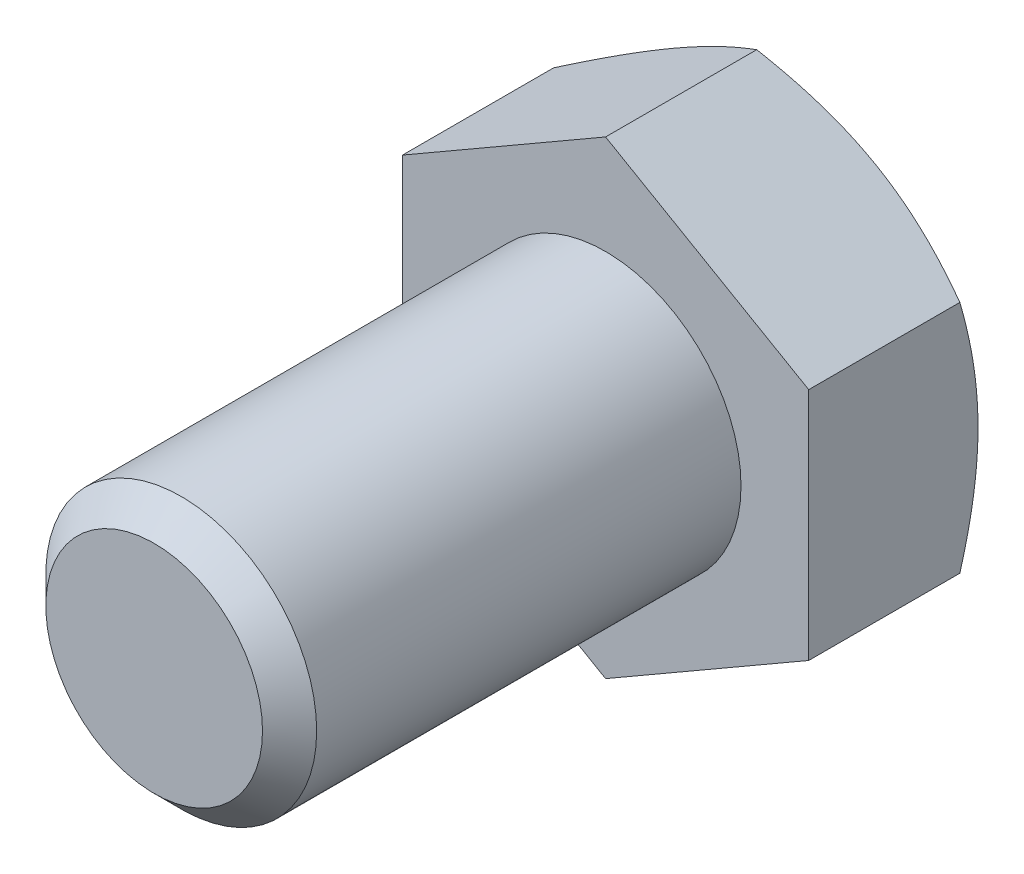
ISO-10303-21;
HEADER;
FILE_DESCRIPTION(('STEP AP214'),'2;1');
FILE_NAME('part.step','',(''),(''),'','','');
FILE_SCHEMA(('AUTOMOTIVE_DESIGN { 1 0 10303 214 1 1 1 1 }'));
ENDSEC;
DATA;
#1=APPLICATION_CONTEXT('core data for automotive mechanical design processes');
#2=APPLICATION_PROTOCOL_DEFINITION('international standard','automotive_design',2000,#1);
#3=PRODUCT_CONTEXT('',#1,'mechanical');
#4=PRODUCT('Part','Part','',(#3));
#5=PRODUCT_RELATED_PRODUCT_CATEGORY('part','',(#4));
#6=PRODUCT_DEFINITION_FORMATION('','',#4);
#7=PRODUCT_DEFINITION_CONTEXT('part definition',#1,'design');
#8=PRODUCT_DEFINITION('design','',#6,#7);
#9=PRODUCT_DEFINITION_SHAPE('','',#8);
#10=(LENGTH_UNIT() NAMED_UNIT(*) SI_UNIT(.MILLI.,.METRE.));
#11=(NAMED_UNIT(*) PLANE_ANGLE_UNIT() SI_UNIT($,.RADIAN.));
#12=(NAMED_UNIT(*) SI_UNIT($,.STERADIAN.) SOLID_ANGLE_UNIT());
#13=UNCERTAINTY_MEASURE_WITH_UNIT(LENGTH_MEASURE(1.E-05),#10,'distance_accuracy_value','');
#14=(GEOMETRIC_REPRESENTATION_CONTEXT(3) GLOBAL_UNCERTAINTY_ASSIGNED_CONTEXT((#13)) GLOBAL_UNIT_ASSIGNED_CONTEXT((#10,
#11,#12)) REPRESENTATION_CONTEXT('',''));
#15=CARTESIAN_POINT('',(0.,0.,0.));
#16=DIRECTION('',(0.,0.,1.));
#17=DIRECTION('',(1.,0.,0.));
#18=AXIS2_PLACEMENT_3D('',#15,#16,#17);
#19=CARTESIAN_POINT('',(0.,0.,20.));
#20=DIRECTION('',(0.,0.,1.));
#21=DIRECTION('',(1.,0.,0.));
#22=AXIS2_PLACEMENT_3D('',#19,#20,#21);
#23=PLANE('',#22);
#24=CARTESIAN_POINT('',(0.,0.,20.));
#25=DIRECTION('',(0.,0.,1.));
#26=DIRECTION('',(1.,0.,0.));
#27=AXIS2_PLACEMENT_3D('',#24,#25,#26);
#28=CIRCLE('',#27,4.8);
#29=CARTESIAN_POINT('',(4.80000000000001,0.,20.));
#30=VERTEX_POINT('',#29);
#31=EDGE_CURVE('E203',#30,#30,#28,.T.);
#32=ORIENTED_EDGE('',*,*,#31,.T.);
#33=EDGE_LOOP('',(#32));
#34=FACE_BOUND('',#33,.T.);
#35=ADVANCED_FACE('F29',(#34),#23,.T.);
#36=CARTESIAN_POINT('',(0.,0.,0.));
#37=DIRECTION('',(0.,0.,1.));
#38=DIRECTION('',(1.,0.,0.));
#39=AXIS2_PLACEMENT_3D('',#36,#37,#38);
#40=CYLINDRICAL_SURFACE('',#39,6.);
#41=CARTESIAN_POINT('',(0.,0.,18.8));
#42=DIRECTION('',(0.,0.,1.));
#43=DIRECTION('',(1.,0.,0.));
#44=AXIS2_PLACEMENT_3D('',#41,#42,#43);
#45=CIRCLE('',#44,6.);
#46=CARTESIAN_POINT('',(6.,0.,18.8));
#47=VERTEX_POINT('',#46);
#48=EDGE_CURVE('E205',#47,#47,#45,.F.);
#49=ORIENTED_EDGE('',*,*,#48,.T.);
#50=EDGE_LOOP('',(#49));
#51=FACE_BOUND('',#50,.T.);
#52=CARTESIAN_POINT('',(0.,0.,0.));
#53=DIRECTION('',(0.,0.,1.));
#54=DIRECTION('',(1.,0.,0.));
#55=AXIS2_PLACEMENT_3D('',#52,#53,#54);
#56=CIRCLE('',#55,6.);
#57=CARTESIAN_POINT('',(6.,0.,0.));
#58=VERTEX_POINT('',#57);
#59=EDGE_CURVE('E206',#58,#58,#56,.F.);
#60=ORIENTED_EDGE('',*,*,#59,.F.);
#61=EDGE_LOOP('',(#60));
#62=FACE_BOUND('',#61,.T.);
#63=ADVANCED_FACE('F194',(#51,#62),#40,.T.);
#64=CARTESIAN_POINT('',(0.,0.,20.));
#65=DIRECTION('',(0.,0.,-1.));
#66=DIRECTION('',(-1.,0.,0.));
#67=AXIS2_PLACEMENT_3D('',#64,#65,#66);
#68=CONICAL_SURFACE('',#67,4.8,0.785398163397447);
#69=ORIENTED_EDGE('',*,*,#48,.F.);
#70=EDGE_LOOP('',(#69));
#71=FACE_BOUND('',#70,.T.);
#72=ORIENTED_EDGE('',*,*,#31,.F.);
#73=EDGE_LOOP('',(#72));
#74=FACE_BOUND('',#73,.T.);
#75=ADVANCED_FACE('F199',(#71,#74),#68,.T.);
#76=CARTESIAN_POINT('',(0.,10.3923048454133,-7.5));
#77=DIRECTION('',(0.499999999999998,0.86602540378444,0.));
#78=DIRECTION('',(-0.86602540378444,0.499999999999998,0.));
#79=AXIS2_PLACEMENT_3D('',#76,#77,#78);
#80=PLANE('',#79);
#81=CARTESIAN_POINT('',(-0.000200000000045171,10.3924203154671,-6.69608575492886));
#82=CARTESIAN_POINT('',(0.197607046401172,10.2782163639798,-6.76201799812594));
#83=CARTESIAN_POINT('',(0.396185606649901,10.1635669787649,-6.82495859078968));
#84=CARTESIAN_POINT('',(0.794955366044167,9.93333715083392,-6.94403100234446));
#85=CARTESIAN_POINT('',(0.995147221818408,9.81775632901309,-7.00015988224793));
#86=CARTESIAN_POINT('',(1.39751505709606,9.5854491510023,-7.10484803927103));
#87=CARTESIAN_POINT('',(1.59969459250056,9.46872074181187,-7.15338922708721));
#88=CARTESIAN_POINT('',(2.00542875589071,9.23447001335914,-7.24185148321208));
#89=CARTESIAN_POINT('',(2.20898309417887,9.11694786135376,-7.28177431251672));
#90=CARTESIAN_POINT('',(2.61230590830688,8.88408932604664,-7.35131532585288));
#91=CARTESIAN_POINT('',(2.81204459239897,8.76877014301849,-7.3811624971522));
#92=CARTESIAN_POINT('',(3.21241567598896,8.53761579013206,-7.43120669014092));
#93=CARTESIAN_POINT('',(3.41304799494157,8.42178066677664,-7.45140456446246));
#94=CARTESIAN_POINT('',(3.81466063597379,8.18990950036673,-7.48164565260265));
#95=CARTESIAN_POINT('',(4.0156403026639,8.07387383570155,-7.4917003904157));
#96=CARTESIAN_POINT('',(4.41778459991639,7.84169571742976,-7.50143766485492));
#97=CARTESIAN_POINT('',(4.61894922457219,7.7255532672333,-7.50112052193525));
#98=CARTESIAN_POINT('',(4.99503261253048,7.50842142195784,-7.49083604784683));
#99=CARTESIAN_POINT('',(5.16997789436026,7.40741671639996,-7.48212325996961));
#100=CARTESIAN_POINT('',(5.51945867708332,7.2056438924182,-7.45702265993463));
#101=CARTESIAN_POINT('',(5.69399414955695,7.10487579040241,-7.44063433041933));
#102=CARTESIAN_POINT('',(6.21692487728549,6.80296159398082,-7.38034344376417));
#103=CARTESIAN_POINT('',(6.5643945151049,6.60234990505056,-7.32532251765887));
#104=CARTESIAN_POINT('',(7.26301962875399,6.19899850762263,-7.18776952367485));
#105=CARTESIAN_POINT('',(7.61408594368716,5.99631027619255,-7.10465438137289));
#106=CARTESIAN_POINT('',(8.3109833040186,5.59395639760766,-6.91601746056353));
#107=CARTESIAN_POINT('',(8.65682327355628,5.39428559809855,-6.81053998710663));
#108=CARTESIAN_POINT('',(9.0002,5.19603695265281,-6.69608575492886));
#109=B_SPLINE_CURVE_WITH_KNOTS('',3,(#81,#82,#83,#84,#85,#86,#87,#88,#89,#90,#91,#92,#93,#94,
#95,#96,#97,#98,#99,#100,#101,#102,#103,#104,#105,#106,#107,#108),.UNSPECIFIED.,.F.,.F.,(4,2,2,
2,2,2,2,2,2,2,2,2,2,4),(0.,0.713219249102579,1.42674513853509,2.14194697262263,2.85700253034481,
3.55449749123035,4.25193080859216,4.94857085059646,5.64518936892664,6.25162976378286,
6.85811104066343,8.07193747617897,9.31268391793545,10.5509947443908),.UNSPECIFIED.);
#110=CARTESIAN_POINT('',(0.,10.3923048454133,-6.69615242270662));
#111=VERTEX_POINT('',#110);
#112=CARTESIAN_POINT('',(4.49999999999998,7.79422863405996,-7.5));
#113=VERTEX_POINT('',#112);
#114=EDGE_CURVE('E239',#111,#113,#109,.T.);
#115=ORIENTED_EDGE('',*,*,#114,.F.);
#116=DIRECTION('',(0.,0.,1.));
#117=VECTOR('',#116,1.);
#118=CARTESIAN_POINT('',(0.,10.3923048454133,-7.5));
#119=LINE('',#118,#117);
#120=CARTESIAN_POINT('',(0.,10.3923048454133,0.));
#121=VERTEX_POINT('',#120);
#122=EDGE_CURVE('E213',#111,#121,#119,.T.);
#123=ORIENTED_EDGE('',*,*,#122,.T.);
#124=DIRECTION('',(-0.86602540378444,0.499999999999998,0.));
#125=VECTOR('',#124,1.);
#126=CARTESIAN_POINT('',(0.,10.3923048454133,0.));
#127=LINE('',#126,#125);
#128=CARTESIAN_POINT('',(9.,5.19615242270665,0.));
#129=VERTEX_POINT('',#128);
#130=EDGE_CURVE('E237',#129,#121,#127,.T.);
#131=ORIENTED_EDGE('',*,*,#130,.F.);
#132=DIRECTION('',(0.,0.,1.));
#133=VECTOR('',#132,1.);
#134=CARTESIAN_POINT('',(9.,5.19615242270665,-7.5));
#135=LINE('',#134,#133);
#136=CARTESIAN_POINT('',(9.,5.19615242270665,-6.69615242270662));
#137=VERTEX_POINT('',#136);
#138=EDGE_CURVE('E210',#137,#129,#135,.T.);
#139=ORIENTED_EDGE('',*,*,#138,.F.);
#140=EDGE_CURVE('E169',#113,#137,#109,.T.);
#141=ORIENTED_EDGE('',*,*,#140,.F.);
#142=EDGE_LOOP('',(#115,#123,#131,#139,#141));
#143=FACE_BOUND('',#142,.T.);
#144=ADVANCED_FACE('F179',(#143),#80,.T.);
#145=CARTESIAN_POINT('',(9.,-5.19615242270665,-7.5));
#146=DIRECTION('',(1.,0.,0.));
#147=DIRECTION('',(0.,0.,-1.));
#148=AXIS2_PLACEMENT_3D('',#145,#146,#147);
#149=PLANE('',#148);
#150=CARTESIAN_POINT('',(9.,-14.1938054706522,-2.9928177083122));
#151=CARTESIAN_POINT('',(9.,-13.7986249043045,-3.18545400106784));
#152=CARTESIAN_POINT('',(9.,-13.4025620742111,-3.37631016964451));
#153=CARTESIAN_POINT('',(9.,-12.6082034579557,-3.75346543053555));
#154=CARTESIAN_POINT('',(9.,-12.2099073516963,-3.93976384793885));
#155=CARTESIAN_POINT('',(9.,-11.4086732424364,-4.30769386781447));
#156=CARTESIAN_POINT('',(9.,-11.005721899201,-4.48929651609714));
#157=CARTESIAN_POINT('',(9.,-10.1966954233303,-4.84537774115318));
#158=CARTESIAN_POINT('',(9.,-9.79062043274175,-5.01985663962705));
#159=CARTESIAN_POINT('',(9.,-8.96081603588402,-5.36560228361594));
#160=CARTESIAN_POINT('',(9.,-8.53695616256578,-5.53655757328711));
#161=CARTESIAN_POINT('',(9.,-7.68436682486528,-5.86609252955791));
#162=CARTESIAN_POINT('',(9.,-7.25563683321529,-6.02467084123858));
#163=CARTESIAN_POINT('',(9.,-6.39334839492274,-6.3254614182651));
#164=CARTESIAN_POINT('',(9.,-5.95980093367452,-6.46770484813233));
#165=CARTESIAN_POINT('',(9.,-5.08650675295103,-6.73142002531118));
#166=CARTESIAN_POINT('',(9.,-4.64676195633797,-6.85289806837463));
#167=CARTESIAN_POINT('',(9.,-3.7631885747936,-7.06875933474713));
#168=CARTESIAN_POINT('',(9.,-3.31939822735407,-7.16329494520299));
#169=CARTESIAN_POINT('',(9.,-2.64948950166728,-7.28091249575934));
#170=CARTESIAN_POINT('',(9.,-2.42546830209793,-7.31608884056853));
#171=CARTESIAN_POINT('',(9.,-1.97623392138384,-7.37769613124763));
#172=CARTESIAN_POINT('',(9.,-1.75102085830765,-7.40412792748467));
#173=CARTESIAN_POINT('',(9.,-1.30274989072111,-7.44737513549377));
#174=CARTESIAN_POINT('',(9.,-1.07970414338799,-7.46431601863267));
#175=CARTESIAN_POINT('',(9.,-0.633095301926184,-7.4887410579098));
#176=CARTESIAN_POINT('',(9.,-0.409532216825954,-7.49622537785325));
#177=CARTESIAN_POINT('',(9.,0.0377121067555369,-7.50155767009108));
#178=CARTESIAN_POINT('',(9.,0.261393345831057,-7.49940559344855));
#179=CARTESIAN_POINT('',(9.,0.70846074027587,-7.48552018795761));
#180=CARTESIAN_POINT('',(9.,0.931846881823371,-7.47378642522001));
#181=CARTESIAN_POINT('',(9.,1.46162752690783,-7.43485039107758));
#182=CARTESIAN_POINT('',(9.,1.76772399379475,-7.40349650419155));
#183=CARTESIAN_POINT('',(9.,2.37778404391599,-7.32445593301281));
#184=CARTESIAN_POINT('',(9.,2.6817473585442,-7.27676722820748));
#185=CARTESIAN_POINT('',(9.,3.59000335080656,-7.1117163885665));
#186=CARTESIAN_POINT('',(9.,4.19036603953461,-6.9723942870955));
#187=CARTESIAN_POINT('',(9.,5.0885815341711,-6.72898039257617));
#188=CARTESIAN_POINT('',(9.,5.39104017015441,-6.64089135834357));
#189=CARTESIAN_POINT('',(9.,5.99302412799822,-6.4551143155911));
#190=CARTESIAN_POINT('',(9.,6.29254942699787,-6.35742623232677));
#191=CARTESIAN_POINT('',(9.,6.88875586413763,-6.15405553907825));
#192=CARTESIAN_POINT('',(9.,7.18543776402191,-6.0483751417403));
#193=CARTESIAN_POINT('',(9.,7.77631041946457,-5.83030807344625));
#194=CARTESIAN_POINT('',(9.,8.07050123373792,-5.71792156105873));
#195=CARTESIAN_POINT('',(9.,8.86768097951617,-5.40462740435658));
#196=CARTESIAN_POINT('',(9.,9.36851420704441,-5.19823951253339));
#197=CARTESIAN_POINT('',(9.,10.3649647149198,-4.77318997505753));
#198=CARTESIAN_POINT('',(9.,10.860581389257,-4.5545269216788));
#199=CARTESIAN_POINT('',(9.,11.8478077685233,-4.10785524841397));
#200=CARTESIAN_POINT('',(9.,12.3394158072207,-3.87984295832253));
#201=CARTESIAN_POINT('',(9.,13.3192435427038,-3.41672758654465));
#202=CARTESIAN_POINT('',(9.,13.8074633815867,-3.18162480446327));
#203=CARTESIAN_POINT('',(9.,14.7819931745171,-2.70549247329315));
#204=CARTESIAN_POINT('',(9.,15.2682986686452,-2.46445381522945));
#205=CARTESIAN_POINT('',(9.,16.2387067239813,-1.97797920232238));
#206=CARTESIAN_POINT('',(9.,16.722809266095,-1.73254320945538));
#207=CARTESIAN_POINT('',(9.,17.6890969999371,-1.23819989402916));
#208=CARTESIAN_POINT('',(9.,18.1712826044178,-0.989293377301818));
#209=CARTESIAN_POINT('',(9.,19.1341609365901,-0.488607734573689));
#210=CARTESIAN_POINT('',(9.,19.6148536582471,-0.23682859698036));
#211=CARTESIAN_POINT('',(9.,20.9522159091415,0.467839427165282));
#212=CARTESIAN_POINT('',(9.,21.8075292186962,0.923301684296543));
#213=CARTESIAN_POINT('',(9.,23.5152984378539,1.83966951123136));
#214=CARTESIAN_POINT('',(9.,24.3677541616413,2.3005754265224));
#215=CARTESIAN_POINT('',(9.,26.0675482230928,3.22485857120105));
#216=CARTESIAN_POINT('',(9.,26.9148940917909,3.68822195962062));
#217=CARTESIAN_POINT('',(9.,28.1846057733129,4.38556367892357));
#218=CARTESIAN_POINT('',(9.,28.6076082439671,4.61838432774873));
#219=CARTESIAN_POINT('',(9.,29.4532343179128,5.08471147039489));
#220=CARTESIAN_POINT('',(9.,29.8758579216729,5.31821796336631));
#221=CARTESIAN_POINT('',(9.,30.2983153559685,5.55202477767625));
#222=B_SPLINE_CURVE_WITH_KNOTS('',3,(#150,#151,#152,#153,#154,#155,#156,#157,#158,#159,#160,
#161,#162,#163,#164,#165,#166,#167,#168,#169,#170,#171,#172,#173,#174,#175,#176,#177,#178,#179,
#180,#181,#182,#183,#184,#185,#186,#187,#188,#189,#190,#191,#192,#193,#194,#195,#196,#197,#198,
#199,#200,#201,#202,#203,#204,#205,#206,#207,#208,#209,#210,#211,#212,#213,#214,#215,#216,#217,
#218,#219,#220,#221),.UNSPECIFIED.,.F.,.F.,(4,2,2,2,2,2,2,2,2,2,2,2,2,2,2,2,2,2,2,2,2,2,2,2,2,2,
2,2,2,2,2,2,2,2,2,4),(0.,1.31891143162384,2.63801699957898,3.9639117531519,5.28974656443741,
6.66070766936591,8.03181864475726,9.40026868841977,10.7683030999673,12.1284389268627,
12.8085936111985,13.488682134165,14.1595537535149,14.8304137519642,15.5012771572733,
16.172170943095,17.094749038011,18.0174412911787,19.8637129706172,20.808703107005,
21.7537006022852,22.6984374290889,23.6431519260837,25.267980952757,26.8929966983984,
28.5186565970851,30.1442479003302,31.7725119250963,33.400790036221,35.0286961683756,
36.6566088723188,39.5636489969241,42.4708746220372,45.3681585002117,46.8166845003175,
48.2652087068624),.UNSPECIFIED.);
#223=CARTESIAN_POINT('',(9.,0.,-7.5));
#224=VERTEX_POINT('',#223);
#225=EDGE_CURVE('E167',#137,#224,#222,.F.);
#226=ORIENTED_EDGE('',*,*,#225,.F.);
#227=ORIENTED_EDGE('',*,*,#138,.T.);
#228=DIRECTION('',(0.,1.,0.));
#229=VECTOR('',#228,1.);
#230=CARTESIAN_POINT('',(9.,-5.19615242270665,0.));
#231=LINE('',#230,#229);
#232=CARTESIAN_POINT('',(9.,-5.19615242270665,0.));
#233=VERTEX_POINT('',#232);
#234=EDGE_CURVE('E215',#233,#129,#231,.T.);
#235=ORIENTED_EDGE('',*,*,#234,.F.);
#236=DIRECTION('',(0.,0.,1.));
#237=VECTOR('',#236,1.);
#238=CARTESIAN_POINT('',(9.,-5.19615242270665,-7.5));
#239=LINE('',#238,#237);
#240=CARTESIAN_POINT('',(9.,-5.19615242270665,-6.69615242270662));
#241=VERTEX_POINT('',#240);
#242=EDGE_CURVE('E221',#241,#233,#239,.T.);
#243=ORIENTED_EDGE('',*,*,#242,.F.);
#244=EDGE_CURVE('E162',#224,#241,#222,.F.);
#245=ORIENTED_EDGE('',*,*,#244,.F.);
#246=EDGE_LOOP('',(#226,#227,#235,#243,#245));
#247=FACE_BOUND('',#246,.T.);
#248=ADVANCED_FACE('F175',(#247),#149,.T.);
#249=CARTESIAN_POINT('',(0.,-10.3923048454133,-7.5));
#250=DIRECTION('',(0.499999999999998,-0.86602540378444,0.));
#251=DIRECTION('',(0.86602540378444,0.499999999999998,0.));
#252=AXIS2_PLACEMENT_3D('',#249,#250,#251);
#253=PLANE('',#252);
#254=CARTESIAN_POINT('',(9.0002,-5.19603695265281,-6.69608575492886));
#255=CARTESIAN_POINT('',(8.80239295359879,-5.31024090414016,-6.76201799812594));
#256=CARTESIAN_POINT('',(8.60381439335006,-5.42489028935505,-6.82495859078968));
#257=CARTESIAN_POINT('',(8.20504463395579,-5.65512011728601,-6.94403100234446));
#258=CARTESIAN_POINT('',(8.00485277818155,-5.77070093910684,-7.00015988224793));
#259=CARTESIAN_POINT('',(7.6024849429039,-6.00300811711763,-7.10484803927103));
#260=CARTESIAN_POINT('',(7.4003054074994,-6.11973652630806,-7.15338922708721));
#261=CARTESIAN_POINT('',(6.99457124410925,-6.35398725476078,-7.24185148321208));
#262=CARTESIAN_POINT('',(6.79101690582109,-6.47150940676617,-7.28177431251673));
#263=CARTESIAN_POINT('',(6.38769409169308,-6.70436794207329,-7.35131532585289));
#264=CARTESIAN_POINT('',(6.18795540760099,-6.81968712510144,-7.3811624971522));
#265=CARTESIAN_POINT('',(5.787584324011,-7.05084147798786,-7.43120669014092));
#266=CARTESIAN_POINT('',(5.58695200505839,-7.16667660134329,-7.45140456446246));
#267=CARTESIAN_POINT('',(5.18533936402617,-7.3985477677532,-7.48164565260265));
#268=CARTESIAN_POINT('',(4.98435969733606,-7.51458343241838,-7.4917003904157));
#269=CARTESIAN_POINT('',(4.58221540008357,-7.74676155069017,-7.50143766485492));
#270=CARTESIAN_POINT('',(4.38105077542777,-7.86290400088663,-7.50112052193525));
#271=CARTESIAN_POINT('',(4.00496738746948,-8.08003584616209,-7.49083604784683));
#272=CARTESIAN_POINT('',(3.83002210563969,-8.18104055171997,-7.48212325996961));
#273=CARTESIAN_POINT('',(3.48054132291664,-8.38281337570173,-7.45702265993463));
#274=CARTESIAN_POINT('',(3.30600585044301,-8.48358147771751,-7.44063433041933));
#275=CARTESIAN_POINT('',(2.78307512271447,-8.78549567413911,-7.38034344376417));
#276=CARTESIAN_POINT('',(2.43560548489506,-8.98610736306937,-7.32532251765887));
#277=CARTESIAN_POINT('',(1.73698037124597,-9.3894587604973,-7.18776952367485));
#278=CARTESIAN_POINT('',(1.38591405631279,-9.59214699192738,-7.10465438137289));
#279=CARTESIAN_POINT('',(0.689016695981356,-9.99450087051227,-6.91601746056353));
#280=CARTESIAN_POINT('',(0.34317672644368,-10.1941716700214,-6.81053998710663));
#281=CARTESIAN_POINT('',(-0.000200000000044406,-10.3924203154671,-6.69608575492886));
#282=B_SPLINE_CURVE_WITH_KNOTS('',3,(#254,#255,#256,#257,#258,#259,#260,#261,#262,#263,#264,
#265,#266,#267,#268,#269,#270,#271,#272,#273,#274,#275,#276,#277,#278,#279,#280,#281),
.UNSPECIFIED.,.F.,.F.,(4,2,2,2,2,2,2,2,2,2,2,2,2,4),(0.,0.713219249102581,1.42674513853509,
2.14194697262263,2.85700253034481,3.55449749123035,4.25193080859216,4.94857085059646,
5.64518936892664,6.25162976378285,6.85811104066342,8.07193747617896,9.31268391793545,
10.5509947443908),.UNSPECIFIED.);
#283=CARTESIAN_POINT('',(4.49999999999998,-7.79422863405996,-7.5));
#284=VERTEX_POINT('',#283);
#285=EDGE_CURVE('E168',#241,#284,#282,.T.);
#286=ORIENTED_EDGE('',*,*,#285,.F.);
#287=ORIENTED_EDGE('',*,*,#242,.T.);
#288=DIRECTION('',(0.86602540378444,0.499999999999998,0.));
#289=VECTOR('',#288,1.);
#290=CARTESIAN_POINT('',(0.,-10.3923048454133,0.));
#291=LINE('',#290,#289);
#292=CARTESIAN_POINT('',(0.,-10.3923048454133,0.));
#293=VERTEX_POINT('',#292);
#294=EDGE_CURVE('E226',#293,#233,#291,.T.);
#295=ORIENTED_EDGE('',*,*,#294,.F.);
#296=DIRECTION('',(0.,0.,1.));
#297=VECTOR('',#296,1.);
#298=CARTESIAN_POINT('',(0.,-10.3923048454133,-7.5));
#299=LINE('',#298,#297);
#300=CARTESIAN_POINT('',(0.,-10.3923048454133,-6.69615242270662));
#301=VERTEX_POINT('',#300);
#302=EDGE_CURVE('E219',#301,#293,#299,.T.);
#303=ORIENTED_EDGE('',*,*,#302,.F.);
#304=EDGE_CURVE('E156',#284,#301,#282,.T.);
#305=ORIENTED_EDGE('',*,*,#304,.F.);
#306=EDGE_LOOP('',(#286,#287,#295,#303,#305));
#307=FACE_BOUND('',#306,.T.);
#308=ADVANCED_FACE('F178',(#307),#253,.T.);
#309=CARTESIAN_POINT('',(0.,-10.3923048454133,-7.5));
#310=DIRECTION('',(-0.500000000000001,-0.866025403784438,0.));
#311=DIRECTION('',(0.866025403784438,-0.500000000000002,0.));
#312=AXIS2_PLACEMENT_3D('',#309,#310,#311);
#313=PLANE('',#312);
#314=CARTESIAN_POINT('',(0.000199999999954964,-10.3924203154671,-6.69608575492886));
#315=CARTESIAN_POINT('',(-0.197607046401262,-10.2782163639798,-6.76201799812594));
#316=CARTESIAN_POINT('',(-0.39618560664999,-10.1635669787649,-6.82495859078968));
#317=CARTESIAN_POINT('',(-0.794955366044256,-9.93333715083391,-6.94403100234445));
#318=CARTESIAN_POINT('',(-0.995147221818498,-9.81775632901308,-7.00015988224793));
#319=CARTESIAN_POINT('',(-1.39751505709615,-9.58544915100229,-7.10484803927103));
#320=CARTESIAN_POINT('',(-1.59969459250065,-9.46872074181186,-7.15338922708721));
#321=CARTESIAN_POINT('',(-2.0054287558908,-9.23447001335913,-7.24185148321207));
#322=CARTESIAN_POINT('',(-2.20898309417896,-9.11694786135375,-7.28177431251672));
#323=CARTESIAN_POINT('',(-2.61230590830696,-8.88408932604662,-7.35131532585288));
#324=CARTESIAN_POINT('',(-2.81204459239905,-8.76877014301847,-7.38116249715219));
#325=CARTESIAN_POINT('',(-3.21241567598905,-8.53761579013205,-7.43120669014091));
#326=CARTESIAN_POINT('',(-3.41304799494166,-8.42178066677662,-7.45140456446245));
#327=CARTESIAN_POINT('',(-3.81466063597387,-8.18990950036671,-7.48164565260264));
#328=CARTESIAN_POINT('',(-4.01564030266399,-8.07387383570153,-7.49170039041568));
#329=CARTESIAN_POINT('',(-4.41778459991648,-7.84169571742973,-7.5014376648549));
#330=CARTESIAN_POINT('',(-4.61894922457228,-7.72555326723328,-7.50112052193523));
#331=CARTESIAN_POINT('',(-4.99503261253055,-7.50842142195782,-7.49083604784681));
#332=CARTESIAN_POINT('',(-5.16997789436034,-7.40741671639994,-7.48212325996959));
#333=CARTESIAN_POINT('',(-5.51945867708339,-7.20564389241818,-7.45702265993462));
#334=CARTESIAN_POINT('',(-5.69399414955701,-7.1048757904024,-7.44063433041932));
#335=CARTESIAN_POINT('',(-6.21692487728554,-6.8029615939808,-7.38034344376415));
#336=CARTESIAN_POINT('',(-6.56439451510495,-6.60234990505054,-7.32532251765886));
#337=CARTESIAN_POINT('',(-7.26301962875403,-6.19899850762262,-7.18776952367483));
#338=CARTESIAN_POINT('',(-7.61408594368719,-5.99631027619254,-7.10465438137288));
#339=CARTESIAN_POINT('',(-8.31098330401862,-5.59395639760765,-6.91601746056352));
#340=CARTESIAN_POINT('',(-8.65682327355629,-5.39428559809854,-6.81053998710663));
#341=CARTESIAN_POINT('',(-9.0002,-5.19603695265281,-6.69608575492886));
#342=B_SPLINE_CURVE_WITH_KNOTS('',3,(#314,#315,#316,#317,#318,#319,#320,#321,#322,#323,#324,
#325,#326,#327,#328,#329,#330,#331,#332,#333,#334,#335,#336,#337,#338,#339,#340,#341),
.UNSPECIFIED.,.F.,.F.,(4,2,2,2,2,2,2,2,2,2,2,2,2,4),(0.,0.713219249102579,1.42674513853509,
2.14194697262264,2.85700253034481,3.55449749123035,4.25193080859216,4.94857085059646,
5.64518936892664,6.25162976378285,6.85811104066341,8.07193747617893,9.31268391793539,
10.5509947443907),.UNSPECIFIED.);
#343=CARTESIAN_POINT('',(-4.50000000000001,-7.79422863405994,-7.5));
#344=VERTEX_POINT('',#343);
#345=EDGE_CURVE('E258',#301,#344,#342,.T.);
#346=ORIENTED_EDGE('',*,*,#345,.F.);
#347=ORIENTED_EDGE('',*,*,#302,.T.);
#348=DIRECTION('',(0.866025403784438,-0.500000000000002,0.));
#349=VECTOR('',#348,1.);
#350=CARTESIAN_POINT('',(0.,-10.3923048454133,0.));
#351=LINE('',#350,#349);
#352=CARTESIAN_POINT('',(-9.,-5.19615242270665,0.));
#353=VERTEX_POINT('',#352);
#354=EDGE_CURVE('E229',#353,#293,#351,.T.);
#355=ORIENTED_EDGE('',*,*,#354,.F.);
#356=DIRECTION('',(0.,0.,1.));
#357=VECTOR('',#356,1.);
#358=CARTESIAN_POINT('',(-9.,-5.19615242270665,-7.5));
#359=LINE('',#358,#357);
#360=CARTESIAN_POINT('',(-9.,-5.19615242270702,-6.69615242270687));
#361=VERTEX_POINT('',#360);
#362=EDGE_CURVE('E217',#361,#353,#359,.T.);
#363=ORIENTED_EDGE('',*,*,#362,.F.);
#364=EDGE_CURVE('E105',#344,#361,#342,.T.);
#365=ORIENTED_EDGE('',*,*,#364,.F.);
#366=EDGE_LOOP('',(#346,#347,#355,#363,#365));
#367=FACE_BOUND('',#366,.T.);
#368=ADVANCED_FACE('F183',(#367),#313,.T.);
#369=CARTESIAN_POINT('',(-9.,-5.19615242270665,-7.5));
#370=DIRECTION('',(-1.,0.,0.));
#371=DIRECTION('',(0.,0.,1.));
#372=AXIS2_PLACEMENT_3D('',#369,#370,#371);
#373=PLANE('',#372);
#374=CARTESIAN_POINT('',(-9.,-14.1938054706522,-2.99281770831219));
#375=CARTESIAN_POINT('',(-9.,-13.7986249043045,-3.18545400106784));
#376=CARTESIAN_POINT('',(-9.,-13.4025620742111,-3.37631016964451));
#377=CARTESIAN_POINT('',(-9.,-12.6082034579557,-3.75346543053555));
#378=CARTESIAN_POINT('',(-9.,-12.2099073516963,-3.93976384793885));
#379=CARTESIAN_POINT('',(-9.,-11.4086732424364,-4.30769386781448));
#380=CARTESIAN_POINT('',(-9.,-11.005721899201,-4.48929651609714));
#381=CARTESIAN_POINT('',(-9.,-10.1966954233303,-4.84537774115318));
#382=CARTESIAN_POINT('',(-9.,-9.79062043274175,-5.01985663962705));
#383=CARTESIAN_POINT('',(-9.,-8.96081603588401,-5.36560228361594));
#384=CARTESIAN_POINT('',(-9.,-8.53695616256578,-5.53655757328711));
#385=CARTESIAN_POINT('',(-9.,-7.68436682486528,-5.86609252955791));
#386=CARTESIAN_POINT('',(-9.,-7.25563683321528,-6.02467084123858));
#387=CARTESIAN_POINT('',(-9.,-6.39334839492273,-6.3254614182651));
#388=CARTESIAN_POINT('',(-9.,-5.95980093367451,-6.46770484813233));
#389=CARTESIAN_POINT('',(-9.,-5.08650675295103,-6.73142002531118));
#390=CARTESIAN_POINT('',(-9.,-4.64676195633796,-6.85289806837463));
#391=CARTESIAN_POINT('',(-9.,-3.76318857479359,-7.06875933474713));
#392=CARTESIAN_POINT('',(-9.,-3.31939822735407,-7.16329494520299));
#393=CARTESIAN_POINT('',(-9.,-2.64948950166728,-7.28091249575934));
#394=CARTESIAN_POINT('',(-9.,-2.42546830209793,-7.31608884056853));
#395=CARTESIAN_POINT('',(-9.,-1.97623392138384,-7.37769613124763));
#396=CARTESIAN_POINT('',(-9.,-1.75102085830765,-7.40412792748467));
#397=CARTESIAN_POINT('',(-9.,-1.3027498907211,-7.44737513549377));
#398=CARTESIAN_POINT('',(-9.,-1.07970414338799,-7.46431601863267));
#399=CARTESIAN_POINT('',(-9.,-0.633095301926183,-7.4887410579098));
#400=CARTESIAN_POINT('',(-9.,-0.409532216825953,-7.49622537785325));
#401=CARTESIAN_POINT('',(-9.,0.0377121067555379,-7.50155767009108));
#402=CARTESIAN_POINT('',(-9.,0.261393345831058,-7.49940559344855));
#403=CARTESIAN_POINT('',(-9.,0.708460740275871,-7.48552018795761));
#404=CARTESIAN_POINT('',(-9.,0.931846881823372,-7.47378642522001));
#405=CARTESIAN_POINT('',(-9.,1.46162752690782,-7.43485039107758));
#406=CARTESIAN_POINT('',(-9.,1.76772399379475,-7.40349650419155));
#407=CARTESIAN_POINT('',(-9.,2.37778404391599,-7.32445593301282));
#408=CARTESIAN_POINT('',(-9.,2.6817473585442,-7.27676722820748));
#409=CARTESIAN_POINT('',(-9.,3.59000335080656,-7.1117163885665));
#410=CARTESIAN_POINT('',(-9.,4.19036603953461,-6.9723942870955));
#411=CARTESIAN_POINT('',(-9.,5.0885815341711,-6.72898039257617));
#412=CARTESIAN_POINT('',(-9.,5.39104017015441,-6.64089135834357));
#413=CARTESIAN_POINT('',(-9.,5.99302412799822,-6.4551143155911));
#414=CARTESIAN_POINT('',(-9.,6.29254942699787,-6.35742623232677));
#415=CARTESIAN_POINT('',(-9.,6.88875586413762,-6.15405553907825));
#416=CARTESIAN_POINT('',(-9.,7.18543776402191,-6.0483751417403));
#417=CARTESIAN_POINT('',(-9.,7.77631041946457,-5.83030807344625));
#418=CARTESIAN_POINT('',(-9.,8.07050123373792,-5.71792156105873));
#419=CARTESIAN_POINT('',(-9.,8.86768097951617,-5.40462740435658));
#420=CARTESIAN_POINT('',(-9.,9.36851420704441,-5.19823951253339));
#421=CARTESIAN_POINT('',(-9.,10.3649647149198,-4.77318997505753));
#422=CARTESIAN_POINT('',(-9.,10.860581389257,-4.5545269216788));
#423=CARTESIAN_POINT('',(-9.,11.8478077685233,-4.10785524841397));
#424=CARTESIAN_POINT('',(-9.,12.3394158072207,-3.87984295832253));
#425=CARTESIAN_POINT('',(-9.,13.3192435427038,-3.41672758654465));
#426=CARTESIAN_POINT('',(-9.,13.8074633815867,-3.18162480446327));
#427=CARTESIAN_POINT('',(-9.,14.7819931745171,-2.70549247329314));
#428=CARTESIAN_POINT('',(-9.,15.2682986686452,-2.46445381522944));
#429=CARTESIAN_POINT('',(-9.,16.2387067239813,-1.97797920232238));
#430=CARTESIAN_POINT('',(-9.,16.7228092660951,-1.73254320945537));
#431=CARTESIAN_POINT('',(-9.,17.6890969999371,-1.23819989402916));
#432=CARTESIAN_POINT('',(-9.,18.1712826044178,-0.98929337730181));
#433=CARTESIAN_POINT('',(-9.,19.1341609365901,-0.488607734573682));
#434=CARTESIAN_POINT('',(-9.,19.6148536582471,-0.236828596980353));
#435=CARTESIAN_POINT('',(-9.,20.9522159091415,0.467839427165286));
#436=CARTESIAN_POINT('',(-9.,21.8075292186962,0.923301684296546));
#437=CARTESIAN_POINT('',(-9.,23.5152984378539,1.83966951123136));
#438=CARTESIAN_POINT('',(-9.,24.3677541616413,2.3005754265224));
#439=CARTESIAN_POINT('',(-9.,26.0675482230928,3.22485857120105));
#440=CARTESIAN_POINT('',(-9.,26.9148940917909,3.68822195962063));
#441=CARTESIAN_POINT('',(-9.,28.184605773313,4.38556367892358));
#442=CARTESIAN_POINT('',(-9.,28.6076082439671,4.61838432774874));
#443=CARTESIAN_POINT('',(-9.,29.4532343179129,5.08471147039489));
#444=CARTESIAN_POINT('',(-9.,29.8758579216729,5.31821796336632));
#445=CARTESIAN_POINT('',(-9.,30.2983153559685,5.55202477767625));
#446=B_SPLINE_CURVE_WITH_KNOTS('',3,(#374,#375,#376,#377,#378,#379,#380,#381,#382,#383,#384,
#385,#386,#387,#388,#389,#390,#391,#392,#393,#394,#395,#396,#397,#398,#399,#400,#401,#402,#403,
#404,#405,#406,#407,#408,#409,#410,#411,#412,#413,#414,#415,#416,#417,#418,#419,#420,#421,#422,
#423,#424,#425,#426,#427,#428,#429,#430,#431,#432,#433,#434,#435,#436,#437,#438,#439,#440,#441,
#442,#443,#444,#445),.UNSPECIFIED.,.F.,.F.,(4,2,2,2,2,2,2,2,2,2,2,2,2,2,2,2,2,2,2,2,2,2,2,2,2,2,
2,2,2,2,2,2,2,2,2,4),(0.,1.31891143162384,2.63801699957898,3.96391175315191,5.28974656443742,
6.66070766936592,8.03181864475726,9.40026868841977,10.7683030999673,12.1284389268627,
12.8085936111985,13.488682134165,14.1595537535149,14.8304137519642,15.5012771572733,
16.172170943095,17.094749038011,18.0174412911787,19.8637129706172,20.808703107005,
21.7537006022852,22.6984374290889,23.6431519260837,25.267980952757,26.8929966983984,
28.5186565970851,30.1442479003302,31.7725119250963,33.400790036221,35.0286961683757,
36.6566088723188,39.5636489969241,42.4708746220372,45.3681585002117,46.8166845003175,
48.2652087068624),.UNSPECIFIED.);
#447=CARTESIAN_POINT('',(-9.00000000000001,0.,-7.5));
#448=VERTEX_POINT('',#447);
#449=EDGE_CURVE('E100',#361,#448,#446,.T.);
#450=ORIENTED_EDGE('',*,*,#449,.F.);
#451=ORIENTED_EDGE('',*,*,#362,.T.);
#452=DIRECTION('',(0.,-1.,0.));
#453=VECTOR('',#452,1.);
#454=CARTESIAN_POINT('',(-9.,-5.19615242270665,0.));
#455=LINE('',#454,#453);
#456=CARTESIAN_POINT('',(-9.,5.19615242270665,0.));
#457=VERTEX_POINT('',#456);
#458=EDGE_CURVE('E232',#457,#353,#455,.T.);
#459=ORIENTED_EDGE('',*,*,#458,.F.);
#460=DIRECTION('',(0.,0.,1.));
#461=VECTOR('',#460,1.);
#462=CARTESIAN_POINT('',(-9.,5.19615242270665,-7.5));
#463=LINE('',#462,#461);
#464=CARTESIAN_POINT('',(-9.,5.19615242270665,-6.69615242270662));
#465=VERTEX_POINT('',#464);
#466=EDGE_CURVE('E126',#465,#457,#463,.T.);
#467=ORIENTED_EDGE('',*,*,#466,.F.);
#468=EDGE_CURVE('E109',#448,#465,#446,.T.);
#469=ORIENTED_EDGE('',*,*,#468,.F.);
#470=EDGE_LOOP('',(#450,#451,#459,#467,#469));
#471=FACE_BOUND('',#470,.T.);
#472=ADVANCED_FACE('F124',(#471),#373,.T.);
#473=CARTESIAN_POINT('',(-9.,5.19615242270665,-7.5));
#474=DIRECTION('',(-0.500000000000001,0.866025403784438,0.));
#475=DIRECTION('',(-0.866025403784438,-0.500000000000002,0.));
#476=AXIS2_PLACEMENT_3D('',#473,#474,#475);
#477=PLANE('',#476);
#478=CARTESIAN_POINT('',(-9.0002,5.19603695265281,-6.69608575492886));
#479=CARTESIAN_POINT('',(-8.80239295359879,5.31024090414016,-6.76201799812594));
#480=CARTESIAN_POINT('',(-8.60381439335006,5.42489028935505,-6.82495859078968));
#481=CARTESIAN_POINT('',(-8.20504463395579,5.65512011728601,-6.94403100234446));
#482=CARTESIAN_POINT('',(-8.00485277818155,5.77070093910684,-7.00015988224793));
#483=CARTESIAN_POINT('',(-7.6024849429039,6.00300811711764,-7.10484803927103));
#484=CARTESIAN_POINT('',(-7.4003054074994,6.11973652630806,-7.15338922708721));
#485=CARTESIAN_POINT('',(-6.99457124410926,6.35398725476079,-7.24185148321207));
#486=CARTESIAN_POINT('',(-6.79101690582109,6.47150940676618,-7.28177431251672));
#487=CARTESIAN_POINT('',(-6.38769409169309,6.70436794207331,-7.35131532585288));
#488=CARTESIAN_POINT('',(-6.187955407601,6.81968712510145,-7.38116249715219));
#489=CARTESIAN_POINT('',(-5.787584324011,7.05084147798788,-7.43120669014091));
#490=CARTESIAN_POINT('',(-5.58695200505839,7.16667660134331,-7.45140456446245));
#491=CARTESIAN_POINT('',(-5.18533936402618,7.39854776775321,-7.48164565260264));
#492=CARTESIAN_POINT('',(-4.98435969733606,7.5145834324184,-7.49170039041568));
#493=CARTESIAN_POINT('',(-4.58221540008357,7.74676155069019,-7.5014376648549));
#494=CARTESIAN_POINT('',(-4.38105077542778,7.86290400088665,-7.50112052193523));
#495=CARTESIAN_POINT('',(-4.0049673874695,8.08003584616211,-7.49083604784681));
#496=CARTESIAN_POINT('',(-3.83002210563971,8.18104055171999,-7.48212325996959));
#497=CARTESIAN_POINT('',(-3.48054132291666,8.38281337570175,-7.45702265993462));
#498=CARTESIAN_POINT('',(-3.30600585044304,8.48358147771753,-7.44063433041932));
#499=CARTESIAN_POINT('',(-2.78307512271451,8.78549567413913,-7.38034344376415));
#500=CARTESIAN_POINT('',(-2.4356054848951,8.98610736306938,-7.32532251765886));
#501=CARTESIAN_POINT('',(-1.73698037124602,9.38945876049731,-7.18776952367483));
#502=CARTESIAN_POINT('',(-1.38591405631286,9.59214699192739,-7.10465438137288));
#503=CARTESIAN_POINT('',(-0.689016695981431,9.99450087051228,-6.91601746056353));
#504=CARTESIAN_POINT('',(-0.343176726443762,10.1941716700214,-6.81053998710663));
#505=CARTESIAN_POINT('',(0.000199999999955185,10.3924203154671,-6.69608575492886));
#506=B_SPLINE_CURVE_WITH_KNOTS('',3,(#478,#479,#480,#481,#482,#483,#484,#485,#486,#487,#488,
#489,#490,#491,#492,#493,#494,#495,#496,#497,#498,#499,#500,#501,#502,#503,#504,#505),
.UNSPECIFIED.,.F.,.F.,(4,2,2,2,2,2,2,2,2,2,2,2,2,4),(0.,0.71321924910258,1.42674513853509,
2.14194697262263,2.85700253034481,3.55449749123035,4.25193080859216,4.94857085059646,
5.64518936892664,6.25162976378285,6.85811104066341,8.07193747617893,9.31268391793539,
10.5509947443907),.UNSPECIFIED.);
#507=CARTESIAN_POINT('',(-4.50000000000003,7.79422863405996,-7.5));
#508=VERTEX_POINT('',#507);
#509=EDGE_CURVE('E115',#465,#508,#506,.T.);
#510=ORIENTED_EDGE('',*,*,#509,.F.);
#511=ORIENTED_EDGE('',*,*,#466,.T.);
#512=DIRECTION('',(-0.866025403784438,-0.500000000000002,0.));
#513=VECTOR('',#512,1.);
#514=CARTESIAN_POINT('',(-9.,5.19615242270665,0.));
#515=LINE('',#514,#513);
#516=EDGE_CURVE('E235',#121,#457,#515,.T.);
#517=ORIENTED_EDGE('',*,*,#516,.F.);
#518=ORIENTED_EDGE('',*,*,#122,.F.);
#519=EDGE_CURVE('E117',#508,#111,#506,.T.);
#520=ORIENTED_EDGE('',*,*,#519,.F.);
#521=EDGE_LOOP('',(#510,#511,#517,#518,#520));
#522=FACE_BOUND('',#521,.T.);
#523=ADVANCED_FACE('F191',(#522),#477,.T.);
#524=CARTESIAN_POINT('',(9.,5.19615242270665,0.));
#525=DIRECTION('',(0.,0.,1.));
#526=DIRECTION('',(1.,0.,0.));
#527=AXIS2_PLACEMENT_3D('',#524,#525,#526);
#528=PLANE('',#527);
#529=ORIENTED_EDGE('',*,*,#59,.T.);
#530=EDGE_LOOP('',(#529));
#531=FACE_BOUND('',#530,.T.);
#532=ORIENTED_EDGE('',*,*,#130,.T.);
#533=ORIENTED_EDGE('',*,*,#516,.T.);
#534=ORIENTED_EDGE('',*,*,#458,.T.);
#535=ORIENTED_EDGE('',*,*,#354,.T.);
#536=ORIENTED_EDGE('',*,*,#294,.T.);
#537=ORIENTED_EDGE('',*,*,#234,.T.);
#538=EDGE_LOOP('',(#532,#533,#534,#535,#536,#537));
#539=FACE_BOUND('',#538,.T.);
#540=ADVANCED_FACE('F148',(#531,#539),#528,.T.);
#541=CARTESIAN_POINT('',(0.,0.,0.));
#542=DIRECTION('',(0.,0.,1.));
#543=DIRECTION('',(1.,0.,0.));
#544=AXIS2_PLACEMENT_3D('',#541,#542,#543);
#545=CONICAL_SURFACE('',#544,21.9903810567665,1.0471975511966);
#546=ORIENTED_EDGE('',*,*,#140,.T.);
#547=ORIENTED_EDGE('',*,*,#225,.T.);
#548=CARTESIAN_POINT('',(0.,0.,-7.5));
#549=DIRECTION('',(0.,0.,1.));
#550=DIRECTION('',(1.,0.,0.));
#551=AXIS2_PLACEMENT_3D('',#548,#549,#550);
#552=CIRCLE('',#551,9.);
#553=EDGE_CURVE('E32',#113,#224,#552,.F.);
#554=ORIENTED_EDGE('',*,*,#553,.F.);
#555=EDGE_LOOP('',(#546,#547,#554));
#556=FACE_BOUND('',#555,.T.);
#557=ADVANCED_FACE('F248',(#556),#545,.T.);
#558=ORIENTED_EDGE('',*,*,#114,.T.);
#559=EDGE_CURVE('E122',#508,#113,#552,.F.);
#560=ORIENTED_EDGE('',*,*,#559,.F.);
#561=ORIENTED_EDGE('',*,*,#519,.T.);
#562=EDGE_LOOP('',(#558,#560,#561));
#563=FACE_BOUND('',#562,.T.);
#564=ADVANCED_FACE('F147',(#563),#545,.T.);
#565=ORIENTED_EDGE('',*,*,#468,.T.);
#566=ORIENTED_EDGE('',*,*,#509,.T.);
#567=CARTESIAN_POINT('',(0.,0.,-7.5));
#568=DIRECTION('',(0.,0.,-1.));
#569=DIRECTION('',(-1.,0.,0.));
#570=AXIS2_PLACEMENT_3D('',#567,#568,#569);
#571=CIRCLE('',#570,9.);
#572=EDGE_CURVE('E50',#448,#508,#571,.T.);
#573=ORIENTED_EDGE('',*,*,#572,.F.);
#574=EDGE_LOOP('',(#565,#566,#573));
#575=FACE_BOUND('',#574,.T.);
#576=ADVANCED_FACE('F113',(#575),#545,.T.);
#577=ORIENTED_EDGE('',*,*,#364,.T.);
#578=ORIENTED_EDGE('',*,*,#449,.T.);
#579=EDGE_CURVE('E102',#344,#448,#552,.F.);
#580=ORIENTED_EDGE('',*,*,#579,.F.);
#581=EDGE_LOOP('',(#577,#578,#580));
#582=FACE_BOUND('',#581,.T.);
#583=ADVANCED_FACE('F101',(#582),#545,.T.);
#584=ORIENTED_EDGE('',*,*,#304,.T.);
#585=ORIENTED_EDGE('',*,*,#345,.T.);
#586=EDGE_CURVE('E37',#284,#344,#552,.F.);
#587=ORIENTED_EDGE('',*,*,#586,.F.);
#588=EDGE_LOOP('',(#584,#585,#587));
#589=FACE_BOUND('',#588,.T.);
#590=ADVANCED_FACE('F260',(#589),#545,.T.);
#591=ORIENTED_EDGE('',*,*,#244,.T.);
#592=ORIENTED_EDGE('',*,*,#285,.T.);
#593=EDGE_CURVE('E11',#224,#284,#552,.F.);
#594=ORIENTED_EDGE('',*,*,#593,.F.);
#595=EDGE_LOOP('',(#591,#592,#594));
#596=FACE_BOUND('',#595,.T.);
#597=ADVANCED_FACE('F255',(#596),#545,.T.);
#598=CARTESIAN_POINT('',(9.,5.19615242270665,-7.5));
#599=DIRECTION('',(0.,0.,1.));
#600=DIRECTION('',(1.,0.,0.));
#601=AXIS2_PLACEMENT_3D('',#598,#599,#600);
#602=PLANE('',#601);
#603=ORIENTED_EDGE('',*,*,#553,.T.);
#604=ORIENTED_EDGE('',*,*,#593,.T.);
#605=ORIENTED_EDGE('',*,*,#586,.T.);
#606=ORIENTED_EDGE('',*,*,#579,.T.);
#607=ORIENTED_EDGE('',*,*,#572,.T.);
#608=ORIENTED_EDGE('',*,*,#559,.T.);
#609=EDGE_LOOP('',(#603,#604,#605,#606,#607,#608));
#610=FACE_BOUND('',#609,.T.);
#611=ADVANCED_FACE('F120',(#610),#602,.F.);
#612=CLOSED_SHELL('',(#35,#63,#75,#144,#248,#308,#368,#472,#523,#540,#557,#564,#576,#583,#590,
#597,#611));
#613=MANIFOLD_SOLID_BREP('B2',#612);
#614=ADVANCED_BREP_SHAPE_REPRESENTATION('',(#18,#613),#14);
#615=SHAPE_DEFINITION_REPRESENTATION(#9,#614);
ENDSEC;
END-ISO-10303-21;
